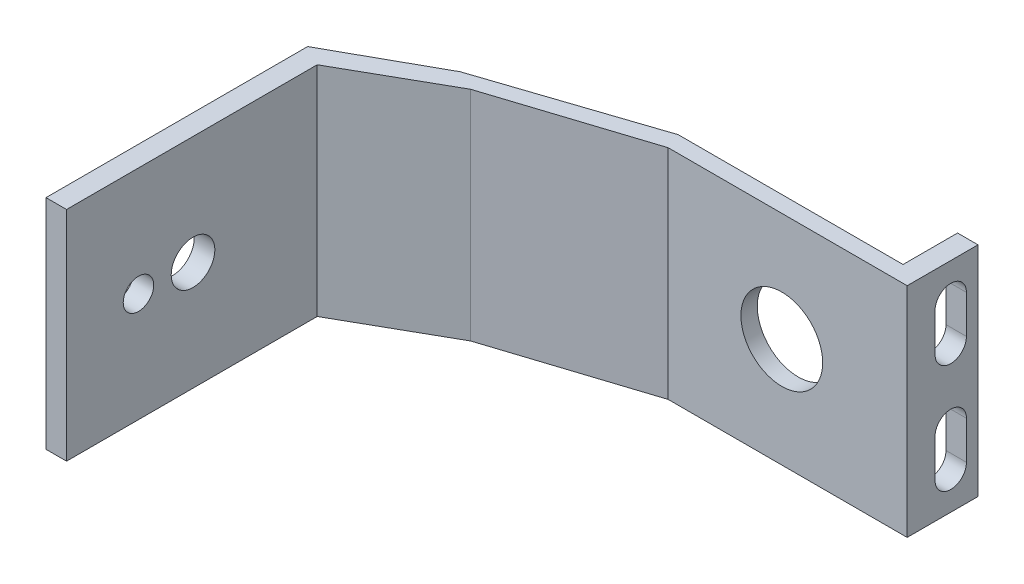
from build123d import *

# Parameters (mm, degrees)
EXTRUDE1_DEPTH     = 25.4
SKETCH2_R          = 4.7625
CUT_EXTRUDE1_DEPTH = 25.4
CUT_EXTRUDE2_DEPTH = 80.43736425
SKETCH4_R          = 1.778
SKETCH4_R_2        = 2.54
CUT_EXTRUDE3_DEPTH = 82.153397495


with BuildPart() as part:
    # Sketch1 → Extrude1 (new body)
    with BuildSketch(Plane(origin=(0, 0, 0), x_dir=(1, 0, 0), z_dir=(0, 1, 0))):
        Polygon((0, 0), (0, 30.48), (11.43, 36.83), (30.48, 43.18), (56.67375, 43.18), (56.67375, 49.53), (59.055, 49.53), (59.055, 43.18), (59.055, 41.277890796), (31.203298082, 41.277890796), (13.803606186, 35.668154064), (2.393972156, 29.202694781), (2.393972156, 0), align=None)
    extrude(amount=EXTRUDE1_DEPTH)

    # Sketch2 → Cut-Extrude1 (cut)
    with BuildSketch(Plane(origin=(0, 0, -43.18), x_dir=(-1, 0, 0), z_dir=(0, 0, -1))):
        with Locations((-92.075, 12.7)):
            Circle(SKETCH2_R)
        with Locations((-44.45, 12.7)):
            Circle(SKETCH2_R)
    extrude(amount=-CUT_EXTRUDE1_DEPTH, mode=Mode.SUBTRACT)

    # Sketch3 → Cut-Extrude2 (cut, through all)
    with BuildSketch(Plane.ZY.offset(-56.67375)):
        with BuildLine():
            Line((-48.1838, 16.8275), (-48.1838, 21.2725))
            ThreePointArc((-48.1838, 21.2725), (-46.355, 23.1013), (-44.5262, 21.2725))
            Line((-44.5262, 21.2725), (-44.5262, 16.8275))
            ThreePointArc((-44.5262, 16.8275), (-46.355, 14.9987), (-48.1838, 16.8275))
        make_face()
        with BuildLine():
            Line((-48.1838, 4.1275), (-48.1838, 8.5725))
            ThreePointArc((-48.1838, 8.5725), (-46.355, 10.4013), (-44.5262, 8.5725))
            Line((-44.5262, 8.5725), (-44.5262, 4.1275))
            ThreePointArc((-44.5262, 4.1275), (-46.355, 2.2987), (-48.1838, 4.1275))
        make_face()
    extrude(amount=-CUT_EXTRUDE2_DEPTH, mode=Mode.SUBTRACT)

    # Sketch4 → Cut-Extrude3 (cut, through all)
    with BuildSketch(Plane.ZY):
        with Locations((-8.382, 12.7)):
            Circle(SKETCH4_R)
        with Locations((-14.732, 12.7)):
            Circle(SKETCH4_R_2)
    extrude(amount=-CUT_EXTRUDE3_DEPTH, mode=Mode.SUBTRACT)


solid = part.part
